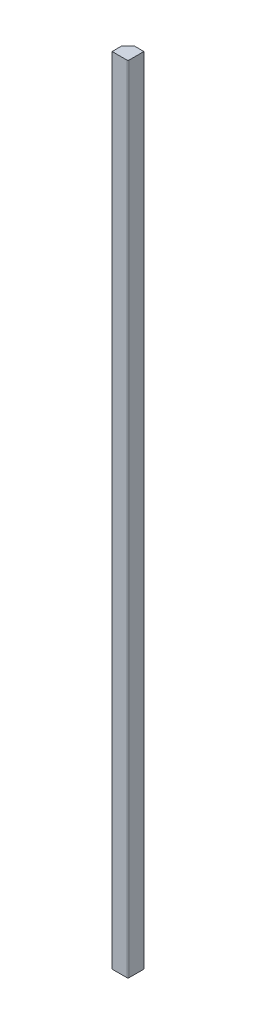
ISO-10303-21;
HEADER;
FILE_DESCRIPTION(('STEP AP214'),'2;1');
FILE_NAME('part.step','',(''),(''),'','','');
FILE_SCHEMA(('AUTOMOTIVE_DESIGN { 1 0 10303 214 1 1 1 1 }'));
ENDSEC;
DATA;
#1=APPLICATION_CONTEXT('core data for automotive mechanical design processes');
#2=APPLICATION_PROTOCOL_DEFINITION('international standard','automotive_design',2000,#1);
#3=PRODUCT_CONTEXT('',#1,'mechanical');
#4=PRODUCT('Part','Part','',(#3));
#5=PRODUCT_RELATED_PRODUCT_CATEGORY('part','',(#4));
#6=PRODUCT_DEFINITION_FORMATION('','',#4);
#7=PRODUCT_DEFINITION_CONTEXT('part definition',#1,'design');
#8=PRODUCT_DEFINITION('design','',#6,#7);
#9=PRODUCT_DEFINITION_SHAPE('','',#8);
#10=(LENGTH_UNIT() NAMED_UNIT(*) SI_UNIT(.MILLI.,.METRE.));
#11=(NAMED_UNIT(*) PLANE_ANGLE_UNIT() SI_UNIT($,.RADIAN.));
#12=(NAMED_UNIT(*) SI_UNIT($,.STERADIAN.) SOLID_ANGLE_UNIT());
#13=UNCERTAINTY_MEASURE_WITH_UNIT(LENGTH_MEASURE(1.E-05),#10,'distance_accuracy_value','');
#14=(GEOMETRIC_REPRESENTATION_CONTEXT(3) GLOBAL_UNCERTAINTY_ASSIGNED_CONTEXT((#13)) GLOBAL_UNIT_ASSIGNED_CONTEXT((#10,
#11,#12)) REPRESENTATION_CONTEXT('',''));
#15=CARTESIAN_POINT('',(0.,0.,0.));
#16=DIRECTION('',(0.,0.,1.));
#17=DIRECTION('',(1.,0.,0.));
#18=AXIS2_PLACEMENT_3D('',#15,#16,#17);
#19=CARTESIAN_POINT('',(0.,2500.,50.));
#20=DIRECTION('',(1.,0.,0.));
#21=DIRECTION('',(0.,0.,-1.));
#22=AXIS2_PLACEMENT_3D('',#19,#20,#21);
#23=PLANE('',#22);
#24=DIRECTION('',(0.,0.,1.));
#25=VECTOR('',#24,1.);
#26=CARTESIAN_POINT('',(0.,0.,50.));
#27=LINE('',#26,#25);
#28=CARTESIAN_POINT('',(0.,0.,20.));
#29=VERTEX_POINT('',#28);
#30=CARTESIAN_POINT('',(0.,0.,50.));
#31=VERTEX_POINT('',#30);
#32=EDGE_CURVE('E79',#29,#31,#27,.T.);
#33=ORIENTED_EDGE('',*,*,#32,.T.);
#34=DIRECTION('',(0.,-1.,0.));
#35=VECTOR('',#34,1.);
#36=CARTESIAN_POINT('',(0.,2500.,50.));
#37=LINE('',#36,#35);
#38=CARTESIAN_POINT('',(0.,2500.,50.));
#39=VERTEX_POINT('',#38);
#40=EDGE_CURVE('E83',#39,#31,#37,.T.);
#41=ORIENTED_EDGE('',*,*,#40,.F.);
#42=DIRECTION('',(0.,0.,1.));
#43=VECTOR('',#42,1.);
#44=CARTESIAN_POINT('',(0.,2500.,50.));
#45=LINE('',#44,#43);
#46=CARTESIAN_POINT('',(0.,2500.,20.));
#47=VERTEX_POINT('',#46);
#48=EDGE_CURVE('E102',#47,#39,#45,.T.);
#49=ORIENTED_EDGE('',*,*,#48,.F.);
#50=DIRECTION('',(0.,-1.,0.));
#51=VECTOR('',#50,1.);
#52=CARTESIAN_POINT('',(0.,2500.,20.));
#53=LINE('',#52,#51);
#54=EDGE_CURVE('E94',#47,#29,#53,.T.);
#55=ORIENTED_EDGE('',*,*,#54,.T.);
#56=EDGE_LOOP('',(#33,#41,#49,#55));
#57=FACE_BOUND('',#56,.T.);
#58=ADVANCED_FACE('F26',(#57),#23,.F.);
#59=CARTESIAN_POINT('',(0.,2500.,50.));
#60=DIRECTION('',(0.,0.,-1.));
#61=DIRECTION('',(-1.,0.,0.));
#62=AXIS2_PLACEMENT_3D('',#59,#60,#61);
#63=PLANE('',#62);
#64=DIRECTION('',(1.,0.,0.));
#65=VECTOR('',#64,1.);
#66=CARTESIAN_POINT('',(0.,0.,50.));
#67=LINE('',#66,#65);
#68=CARTESIAN_POINT('',(47.,0.,50.));
#69=VERTEX_POINT('',#68);
#70=EDGE_CURVE('E74',#31,#69,#67,.T.);
#71=ORIENTED_EDGE('',*,*,#70,.T.);
#72=DIRECTION('',(0.,-1.,0.));
#73=VECTOR('',#72,1.);
#74=CARTESIAN_POINT('',(47.,2500.,50.));
#75=LINE('',#74,#73);
#76=CARTESIAN_POINT('',(47.,2500.,50.));
#77=VERTEX_POINT('',#76);
#78=EDGE_CURVE('E33',#69,#77,#75,.F.);
#79=ORIENTED_EDGE('',*,*,#78,.T.);
#80=DIRECTION('',(1.,0.,0.));
#81=VECTOR('',#80,1.);
#82=CARTESIAN_POINT('',(0.,2500.,50.));
#83=LINE('',#82,#81);
#84=EDGE_CURVE('E85',#39,#77,#83,.T.);
#85=ORIENTED_EDGE('',*,*,#84,.F.);
#86=ORIENTED_EDGE('',*,*,#40,.T.);
#87=EDGE_LOOP('',(#71,#79,#85,#86));
#88=FACE_BOUND('',#87,.T.);
#89=ADVANCED_FACE('F84',(#88),#63,.F.);
#90=CARTESIAN_POINT('',(50.,2500.,0.));
#91=DIRECTION('',(-1.,0.,0.));
#92=DIRECTION('',(0.,0.,1.));
#93=AXIS2_PLACEMENT_3D('',#90,#91,#92);
#94=PLANE('',#93);
#95=DIRECTION('',(0.,0.,-1.));
#96=VECTOR('',#95,1.);
#97=CARTESIAN_POINT('',(50.,2500.,0.));
#98=LINE('',#97,#96);
#99=CARTESIAN_POINT('',(50.,2500.,47.));
#100=VERTEX_POINT('',#99);
#101=CARTESIAN_POINT('',(50.,2500.,0.));
#102=VERTEX_POINT('',#101);
#103=EDGE_CURVE('E105',#100,#102,#98,.T.);
#104=ORIENTED_EDGE('',*,*,#103,.F.);
#105=DIRECTION('',(0.,-1.,0.));
#106=VECTOR('',#105,1.);
#107=CARTESIAN_POINT('',(50.,2500.,47.));
#108=LINE('',#107,#106);
#109=CARTESIAN_POINT('',(50.,0.,47.));
#110=VERTEX_POINT('',#109);
#111=EDGE_CURVE('E89',#100,#110,#108,.T.);
#112=ORIENTED_EDGE('',*,*,#111,.T.);
#113=DIRECTION('',(0.,0.,-1.));
#114=VECTOR('',#113,1.);
#115=CARTESIAN_POINT('',(50.,0.,0.));
#116=LINE('',#115,#114);
#117=CARTESIAN_POINT('',(50.,0.,0.));
#118=VERTEX_POINT('',#117);
#119=EDGE_CURVE('E80',#110,#118,#116,.T.);
#120=ORIENTED_EDGE('',*,*,#119,.T.);
#121=DIRECTION('',(0.,-1.,0.));
#122=VECTOR('',#121,1.);
#123=CARTESIAN_POINT('',(50.,2500.,0.));
#124=LINE('',#123,#122);
#125=EDGE_CURVE('E90',#102,#118,#124,.T.);
#126=ORIENTED_EDGE('',*,*,#125,.F.);
#127=EDGE_LOOP('',(#104,#112,#120,#126));
#128=FACE_BOUND('',#127,.T.);
#129=ADVANCED_FACE('F122',(#128),#94,.F.);
#130=CARTESIAN_POINT('',(20.,2500.,0.));
#131=DIRECTION('',(0.,0.,1.));
#132=DIRECTION('',(1.,0.,0.));
#133=AXIS2_PLACEMENT_3D('',#130,#131,#132);
#134=PLANE('',#133);
#135=DIRECTION('',(-1.,0.,0.));
#136=VECTOR('',#135,1.);
#137=CARTESIAN_POINT('',(20.,0.,0.));
#138=LINE('',#137,#136);
#139=CARTESIAN_POINT('',(20.,0.,0.));
#140=VERTEX_POINT('',#139);
#141=EDGE_CURVE('E98',#118,#140,#138,.T.);
#142=ORIENTED_EDGE('',*,*,#141,.T.);
#143=DIRECTION('',(0.,-1.,0.));
#144=VECTOR('',#143,1.);
#145=CARTESIAN_POINT('',(20.,2500.,0.));
#146=LINE('',#145,#144);
#147=CARTESIAN_POINT('',(20.,2500.,0.));
#148=VERTEX_POINT('',#147);
#149=EDGE_CURVE('E112',#148,#140,#146,.T.);
#150=ORIENTED_EDGE('',*,*,#149,.F.);
#151=DIRECTION('',(-1.,0.,0.));
#152=VECTOR('',#151,1.);
#153=CARTESIAN_POINT('',(20.,2500.,0.));
#154=LINE('',#153,#152);
#155=EDGE_CURVE('E107',#102,#148,#154,.T.);
#156=ORIENTED_EDGE('',*,*,#155,.F.);
#157=ORIENTED_EDGE('',*,*,#125,.T.);
#158=EDGE_LOOP('',(#142,#150,#156,#157));
#159=FACE_BOUND('',#158,.T.);
#160=ADVANCED_FACE('F129',(#159),#134,.F.);
#161=CARTESIAN_POINT('',(0.,2500.,20.));
#162=DIRECTION('',(0.707106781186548,0.,0.707106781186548));
#163=DIRECTION('',(0.707106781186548,0.,-0.707106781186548));
#164=AXIS2_PLACEMENT_3D('',#161,#162,#163);
#165=PLANE('',#164);
#166=DIRECTION('',(-0.707106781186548,0.,0.707106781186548));
#167=VECTOR('',#166,1.);
#168=CARTESIAN_POINT('',(0.,0.,20.));
#169=LINE('',#168,#167);
#170=EDGE_CURVE('E100',#140,#29,#169,.T.);
#171=ORIENTED_EDGE('',*,*,#170,.T.);
#172=ORIENTED_EDGE('',*,*,#54,.F.);
#173=DIRECTION('',(-0.707106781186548,0.,0.707106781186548));
#174=VECTOR('',#173,1.);
#175=CARTESIAN_POINT('',(0.,2500.,20.));
#176=LINE('',#175,#174);
#177=EDGE_CURVE('E109',#148,#47,#176,.T.);
#178=ORIENTED_EDGE('',*,*,#177,.F.);
#179=ORIENTED_EDGE('',*,*,#149,.T.);
#180=EDGE_LOOP('',(#171,#172,#178,#179));
#181=FACE_BOUND('',#180,.T.);
#182=ADVANCED_FACE('F133',(#181),#165,.F.);
#183=CARTESIAN_POINT('',(0.,2500.,0.));
#184=DIRECTION('',(0.,-1.,0.));
#185=DIRECTION('',(0.,0.,-1.));
#186=AXIS2_PLACEMENT_3D('',#183,#184,#185);
#187=PLANE('',#186);
#188=ORIENTED_EDGE('',*,*,#84,.T.);
#189=CARTESIAN_POINT('',(47.,2500.,47.));
#190=DIRECTION('',(0.,-1.,0.));
#191=DIRECTION('',(0.,0.,-1.));
#192=AXIS2_PLACEMENT_3D('',#189,#190,#191);
#193=CIRCLE('',#192,3.);
#194=EDGE_CURVE('E11',#77,#100,#193,.F.);
#195=ORIENTED_EDGE('',*,*,#194,.T.);
#196=ORIENTED_EDGE('',*,*,#103,.T.);
#197=ORIENTED_EDGE('',*,*,#155,.T.);
#198=ORIENTED_EDGE('',*,*,#177,.T.);
#199=ORIENTED_EDGE('',*,*,#48,.T.);
#200=EDGE_LOOP('',(#188,#195,#196,#197,#198,#199));
#201=FACE_BOUND('',#200,.T.);
#202=ADVANCED_FACE('F135',(#201),#187,.F.);
#203=CARTESIAN_POINT('',(0.,0.,0.));
#204=DIRECTION('',(0.,-1.,0.));
#205=DIRECTION('',(0.,0.,-1.));
#206=AXIS2_PLACEMENT_3D('',#203,#204,#205);
#207=PLANE('',#206);
#208=ORIENTED_EDGE('',*,*,#119,.F.);
#209=CARTESIAN_POINT('',(47.,0.,47.));
#210=DIRECTION('',(0.,-1.,0.));
#211=DIRECTION('',(0.,0.,-1.));
#212=AXIS2_PLACEMENT_3D('',#209,#210,#211);
#213=CIRCLE('',#212,3.);
#214=EDGE_CURVE('E47',#110,#69,#213,.T.);
#215=ORIENTED_EDGE('',*,*,#214,.T.);
#216=ORIENTED_EDGE('',*,*,#70,.F.);
#217=ORIENTED_EDGE('',*,*,#32,.F.);
#218=ORIENTED_EDGE('',*,*,#170,.F.);
#219=ORIENTED_EDGE('',*,*,#141,.F.);
#220=EDGE_LOOP('',(#208,#215,#216,#217,#218,#219));
#221=FACE_BOUND('',#220,.T.);
#222=ADVANCED_FACE('F76',(#221),#207,.T.);
#223=CARTESIAN_POINT('',(47.,2500.,47.));
#224=DIRECTION('',(0.,-1.,0.));
#225=DIRECTION('',(0.,0.,-1.));
#226=AXIS2_PLACEMENT_3D('',#223,#224,#225);
#227=CYLINDRICAL_SURFACE('',#226,3.);
#228=ORIENTED_EDGE('',*,*,#194,.F.);
#229=ORIENTED_EDGE('',*,*,#78,.F.);
#230=ORIENTED_EDGE('',*,*,#214,.F.);
#231=ORIENTED_EDGE('',*,*,#111,.F.);
#232=EDGE_LOOP('',(#228,#229,#230,#231));
#233=FACE_BOUND('',#232,.T.);
#234=ADVANCED_FACE('F136',(#233),#227,.T.);
#235=CLOSED_SHELL('',(#58,#89,#129,#160,#182,#202,#222,#234));
#236=MANIFOLD_SOLID_BREP('B2',#235);
#237=ADVANCED_BREP_SHAPE_REPRESENTATION('',(#18,#236),#14);
#238=SHAPE_DEFINITION_REPRESENTATION(#9,#237);
ENDSEC;
END-ISO-10303-21;
